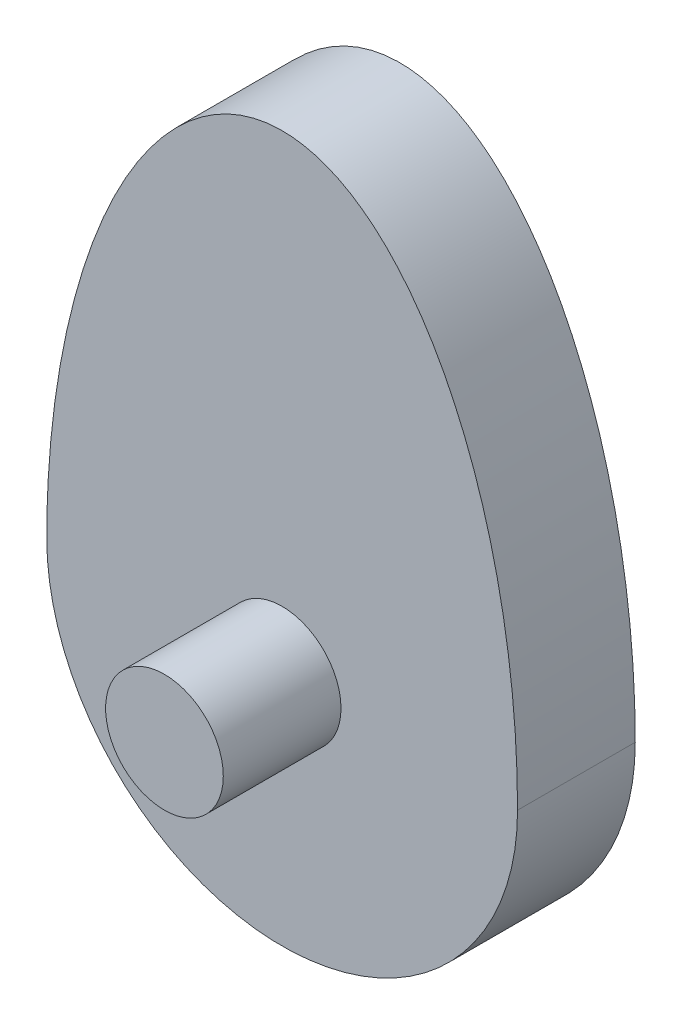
from build123d import *

# Parameters (mm, degrees)
DODANIE_WYCI_GNI_CIE1_DEPTH = 20
SZKIC2_R                    = 10
DODANIE_WYCI_GNI_CIE2_DEPTH = 20
SZKIC3_R                    = 15
SZKIC3_R_2                  = 5
DODANIE_WYCI_GNI_CIE3_DEPTH = 10


with BuildPart() as part:
    # Szkic1 → Dodanie-wyci_gni_cie1 (new body)
    with BuildSketch(Plane.XY):
        with BuildLine():
            ThreePointArc((-40, 0), (0, -40), (40, 0))
            add(Edge.make_bspline(
                [(40, 0), (40, 80), (0, 80), (-40, 80), (-40, 0)],
                knots=[4.71238898, 4.71238898, 4.71238898, 6.283185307, 6.283185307, 7.853981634, 7.853981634, 7.853981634], degree=2, weights=[1, 0.707106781, 1, 0.707106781, 1]))
        make_face()
    extrude(amount=DODANIE_WYCI_GNI_CIE1_DEPTH)

    # Szkic2 → Dodanie-wyci_gni_cie2 (add)
    with BuildSketch(Plane.XY.offset(20)):
        Circle(SZKIC2_R)
    extrude(amount=DODANIE_WYCI_GNI_CIE2_DEPTH)

    # Szkic3 → Dodanie-wyci_gni_cie3 (add)
    with BuildSketch(Plane(origin=(0, 0, 0), x_dir=(-1, 0, 0), z_dir=(0, 0, -1))):
        with Locations(Location((0, 0, 0), (0, 0, 180))):
            Circle(SZKIC3_R)
        Circle(SZKIC3_R_2, mode=Mode.SUBTRACT)
    extrude(amount=DODANIE_WYCI_GNI_CIE3_DEPTH)


solid = part.part
